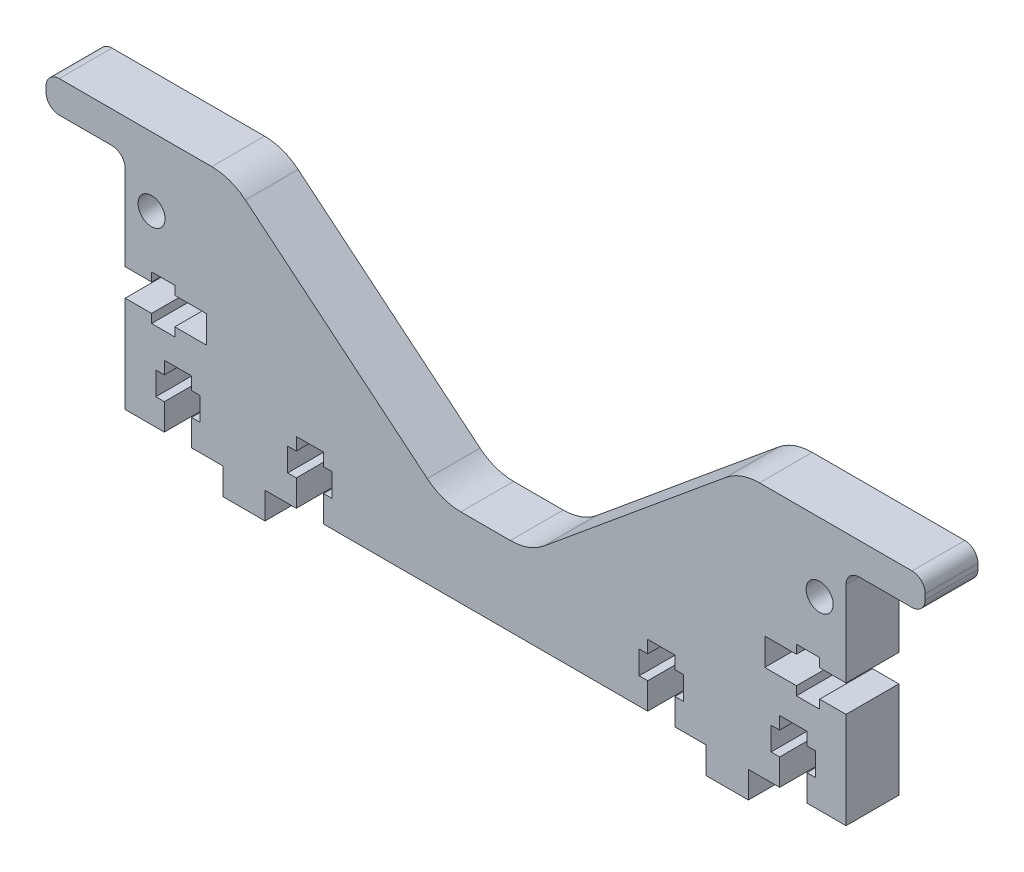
from build123d import *

# Parameters (mm, degrees)
BOSS_EXTRUDE1_DEPTH = 12.7
FILLET1_R           = 12.7
FILLET2_R           = 3.175
SKETCH3_R           = 3.25
CUT_EXTRUDE1_DEPTH  = 123.780551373
CUT_EXTRUDE2_DEPTH  = 123.780551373
SKETCH6_W           = 10.16
SKETCH6_H           = 6.4008
BOSS_EXTRUDE2_DEPTH = 12.7


with BuildPart() as part:
    # Sketch1 → Boss-Extrude1 (new body)
    with BuildSketch(Plane.XY):
        Polygon((86.726, 0), (86.726, 53.414511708), (105.776, 53.414511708), (105.776, 61.034511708), (61.326, 61.034511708), (10.526, 19.05), (-10.526, 19.05), (-61.326, 61.034511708), (-105.776, 61.034511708), (-105.776, 53.414511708), (-86.726, 53.414511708), (-86.726, 0), align=None)
    extrude(amount=-BOSS_EXTRUDE1_DEPTH)

    # Fillet1
    fillet1_edges = [part.edges().sort_by_distance(p)[0] for p in [
        (-61.326, 61.034511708, -6.35),
        (-10.526, 19.05, -6.35),
        (10.526, 19.05, -6.35),
        (61.326, 61.034511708, -6.35),
    ]]
    fillet(fillet1_edges, radius=FILLET1_R)

    # Fillet2
    fillet2_edges = [part.edges().sort_by_distance(p)[0] for p in [
        (-86.726, 53.414511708, -6.35),
        (-105.776, 53.414511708, -6.35),
        (-105.776, 61.034511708, -6.35),
        (105.776, 61.034511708, -6.35),
        (105.776, 53.414511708, -6.35),
        (86.726, 53.414511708, -6.35),
    ]]
    fillet(fillet2_edges, radius=FILLET2_R)

    # Sketch3 → Cut-Extrude1 (cut, through all)
    with BuildSketch(Plane.XY):
        with Locations((80.376, 44.524511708)):
            Circle(SKETCH3_R)
        with Locations(Location((-80.376, 44.524511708, 0), (0, 0, 180))):
            Circle(SKETCH3_R)
    extrude(amount=-CUT_EXTRUDE1_DEPTH, mode=Mode.SUBTRACT)

    # Sketch4 → Cut-Extrude2 (cut, through all)
    with BuildSketch(Plane.XY):
        Polygon((86.726, 29.756717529), (80.376, 29.756717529), (80.376, 31.864917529), (74.788, 31.864917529), (74.788, 29.756717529), (67.168, 29.756717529), (67.168, 23.206717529), (74.788, 23.206717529), (74.788, 21.098517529), (80.376, 21.098517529), (80.376, 23.206717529), (86.726, 23.206717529), align=None)
        Polygon((77.3026, 0), (77.3026, 6.35), (79.36, 6.35), (79.36, 11.938), (77.3026, 11.938), (77.3026, 14.986), (70.7494, 14.986), (70.7494, 11.938), (68.692, 11.938), (68.692, 6.35), (70.7494, 6.35), (70.7494, 0), align=None)
        Polygon((-77.3026, 0), (-70.7494, 0), (-70.7494, 6.35), (-68.692, 6.35), (-68.692, 11.938), (-70.7494, 11.938), (-70.7494, 14.986), (-77.3026, 14.986), (-77.3026, 11.938), (-79.36, 11.938), (-79.36, 6.35), (-77.3026, 6.35), align=None)
        Polygon((-86.726, 29.756717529), (-86.726, 23.206717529), (-80.376, 23.206717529), (-80.376, 21.098517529), (-74.788, 21.098517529), (-74.788, 23.206717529), (-67.168, 23.206717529), (-67.168, 29.756717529), (-74.788, 29.756717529), (-74.788, 31.864917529), (-80.376, 31.864917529), (-80.376, 29.756717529), align=None)
        Polygon((38.9994, 0), (45.5526, 0), (45.5526, 6.35), (47.61, 6.35), (47.61, 11.938), (45.5526, 11.938), (45.5526, 14.986), (38.9994, 14.986), (38.9994, 11.938), (36.942, 11.938), (36.942, 6.35), (38.9994, 6.35), align=None)
        Polygon((-38.9994, 0), (-38.9994, 6.35), (-36.942, 6.35), (-36.942, 11.938), (-38.9994, 11.938), (-38.9994, 14.986), (-45.5526, 14.986), (-45.5526, 11.938), (-47.61, 11.938), (-47.61, 6.35), (-45.5526, 6.35), (-45.5526, 0), align=None)
    extrude(amount=-CUT_EXTRUDE2_DEPTH, mode=Mode.SUBTRACT)

    # Sketch6 → Boss-Extrude2 (add)
    with BuildSketch(Plane.XY):
        with Locations((-58.151, -3.2004)):
            Rectangle(SKETCH6_W, SKETCH6_H)
        with Locations((58.151, -3.2004)):
            Rectangle(SKETCH6_W, SKETCH6_H)
    extrude(amount=-BOSS_EXTRUDE2_DEPTH)


solid = part.part
